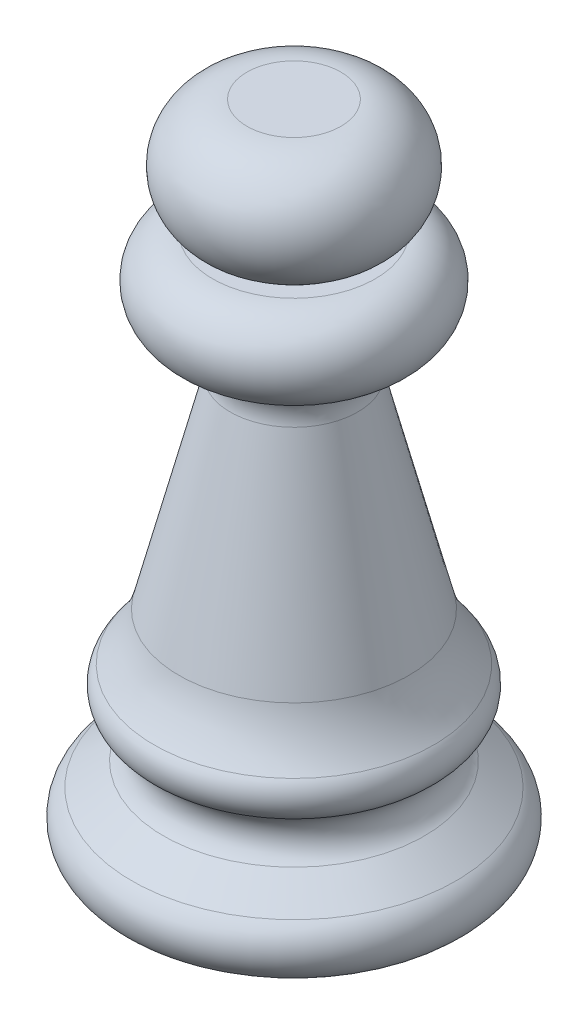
from build123d import *


with BuildPart() as part:
    # Sketch1 → Base-Revolve (revolve)
    with BuildSketch(Plane.XY, mode=Mode.PRIVATE) as base_revolve_sk:
        with BuildLine():
            Line((0, 0), (13.97, 0))
            ThreePointArc((13.97, 0), (16.867278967, 2.101385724), (15.769609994, 5.508021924))
            Line((15.769609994, 5.508021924), (12.694582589, 7.757534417))
            ThreePointArc((12.694582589, 7.757534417), (11.658435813, 9.953182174), (12.939128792, 12.015776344))
            ThreePointArc((12.939128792, 12.015776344), (14.18678061, 13.790768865), (13.608346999, 15.881856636))
            ThreePointArc((13.608346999, 15.881856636), (12.127698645, 18.067645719), (11.18803732, 20.534836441))
            Line((11.18803732, 20.534836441), (6.197148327, 40.232385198))
            ThreePointArc((6.197148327, 40.232385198), (6.601144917, 42.798627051), (8.736324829, 44.278430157))
            ThreePointArc((8.736324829, 44.278430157), (11.965295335, 48.669265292), (7.921955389, 52.324))
            Line((7.921955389, 52.324), (4.572, 52.324))
            ThreePointArc((4.572, 52.324), (10.16, 57.912), (4.572, 63.5))
            Line((4.572, 63.5), (0, 63.5))
            Line((0, 63.5), (0, 0))
        make_face()
    revolve(base_revolve_sk.sketch.rotate(Axis((0, 0, 0), (0, 1, 0)), 90), axis=Axis((0, 0, 0), (0, 1, 0)))


solid = part.part
